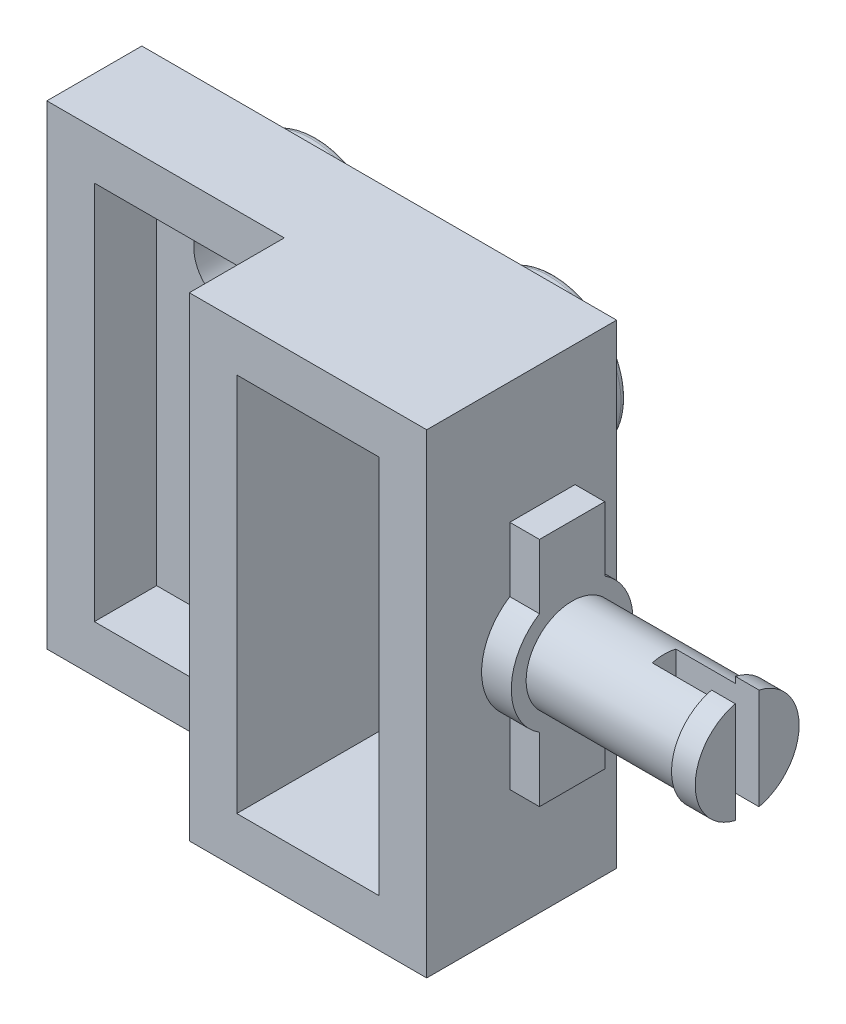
from build123d import *

# Parameters (mm, degrees)
SKIZZE1_W                         = 16
SKIZZE1_H                         = 16
LINEAR_AUSTRAGEN1_DEPTH           = 3.2
SKIZZE2_W                         = 12.8
SKIZZE2_H                         = 12.8
SCHNITT_LINEAR_AUSTRAGEN1_DEPTH   = 2.1
SKIZZE4_R                         = 2.45
LINEAR_AUSTRAGEN3_DEPTH           = 1.9
VERRUNDUNG1_R                     = 0.2
SKIZZE9_R                         = 1.25
LINEAR_AUSTRAGEN5_DEPTH           = 1.8
SKIZZE9_2_R                       = 1.25
SCHNITT_LINEAR_AUSTRAGEN3_DEPTH   = 1.8
LINEARES_MUSTER3_COUNT            = 2
LINEARES_MUSTER3_PITCH            = 8
LINEARES_MUSTER3_COUNT_DIR2       = 2
LINEARES_MUSTER3_PITCH_DIR2       = 8
VERRUNDUNG1_OF_LINEARES_MUSTER3_R = 0.2
SKIZZE10_W                        = 8
SKIZZE10_H                        = 16
SKIZZE10_W_2                      = 4.8
SKIZZE10_H_2                      = 12.8
LINEAR_AUSTRAGEN6_DEPTH           = 5.3
LINEAR_AUSTRAGEN7_DEPTH           = 1
SKIZZE12_R                        = 1.55
LINEAR_AUSTRAGEN8_DEPTH           = 5.1
SKIZZE13_R                        = 1.75
LINEAR_AUSTRAGEN9_DEPTH           = 0.8
SCHNITT_LINEAR_START              = -2.8
SCHNITT_LINEAR_AUSTRAGEN4_DEPTH   = 2.8


with BuildPart() as part:
    # Skizze1 → Linear austragen1 (new body)
    with BuildSketch(Plane.XY):
        with Locations((-8, -8)):
            Rectangle(SKIZZE1_W, SKIZZE1_H)
    extrude(amount=LINEAR_AUSTRAGEN1_DEPTH)

    # Skizze2 → Schnitt-Linear austragen1 (cut)
    with BuildSketch(Plane.XY.offset(3.2)):
        with Locations((-8, -8)):
            Rectangle(SKIZZE2_W, SKIZZE2_H)
    extrude(amount=-SCHNITT_LINEAR_AUSTRAGEN1_DEPTH, mode=Mode.SUBTRACT)

    # Skizze4 → Linear austragen3 (add)
    with BuildSketch(Plane(origin=(0, 0, 0), x_dir=(-1, 0, 0), z_dir=(0, 0, -1))):
        with Locations(Location((4, -4, 0), (0, 0, 180))):
            Circle(SKIZZE4_R)
    linear_austragen3 = extrude(amount=LINEAR_AUSTRAGEN3_DEPTH)

    # Verrundung1
    verrundung1_edges = [part.edges().sort_by_distance(p)[0] for p in [
        (-6.45, -4, -1.9),
    ]]
    fillet(verrundung1_edges, radius=VERRUNDUNG1_R)

    # Skizze9 → Linear austragen5 (add)
    with BuildSketch(Plane.XY.offset(1.1)):
        with Locations((-3.9, -3.9)):
            Circle(SKIZZE9_R)
    extrude(amount=-LINEAR_AUSTRAGEN5_DEPTH)

    # Skizze9_2 → Schnitt-Linear austragen3 (cut)
    with BuildSketch(Plane.XY.offset(1.1)):
        with Locations((-3.9, -3.9)):
            Circle(SKIZZE9_2_R)
    schnitt_linear_austragen3 = extrude(amount=-SCHNITT_LINEAR_AUSTRAGEN3_DEPTH, mode=Mode.SUBTRACT)

    # Lineares Muster3: Linear austragen3, Schnitt-Linear austragen3 2 × 2
    with Locations(*[(-j * LINEARES_MUSTER3_PITCH_DIR2, -i * LINEARES_MUSTER3_PITCH, 0) for i in range(LINEARES_MUSTER3_COUNT) for j in range(LINEARES_MUSTER3_COUNT_DIR2) if (i, j) != (0, 0)]):
        add(linear_austragen3)
        add(schnitt_linear_austragen3, mode=Mode.SUBTRACT)

    # Verrundung1 of Lineares Muster3
    verrundung1_of_lineares_muster3_edges = [part.edges().sort_by_distance(p)[0] for p in [
        (-14.45, -4, -1.9),
        (-6.45, -12, -1.9),
        (-14.45, -12, -1.9),
    ]]
    fillet(verrundung1_of_lineares_muster3_edges, radius=VERRUNDUNG1_OF_LINEARES_MUSTER3_R)

    # Skizze10 → Linear austragen6 (add)
    with BuildSketch(Plane.XY.offset(1.1)):
        with Locations((-4, -8)):
            Rectangle(SKIZZE10_W, SKIZZE10_H)
        with Locations((-4, -8)):
            Rectangle(SKIZZE10_W_2, SKIZZE10_H_2, mode=Mode.SUBTRACT)
    extrude(amount=LINEAR_AUSTRAGEN6_DEPTH)

    # Skizze11 → Linear austragen7 (add)
    with BuildSketch(Plane(origin=(0, 0, 0), x_dir=(0, 0, -1), z_dir=(1, 0, 0))):
        with BuildLine():
            Line((-3.6, -9.729884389), (-3.6, -11.9))
            Line((-3.6, -11.9), (-1.4, -11.9))
            Line((-1.4, -11.9), (-1.4, -9.729884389))
            ThreePointArc((-1.4, -9.729884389), (-0.45, -8), (-1.4, -6.270115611))
            Line((-1.4, -6.270115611), (-1.4, -4.1))
            Line((-1.4, -4.1), (-3.6, -4.1))
            Line((-3.6, -4.1), (-3.6, -6.270115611))
            ThreePointArc((-3.6, -6.270115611), (-4.55, -8), (-3.6, -9.729884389))
        make_face()
    extrude(amount=LINEAR_AUSTRAGEN7_DEPTH)

    # Skizze12 → Linear austragen8 (add)
    with BuildSketch(Plane(origin=(1, 0, 0), x_dir=(0, 0, -1), z_dir=(1, 0, 0))):
        with Locations(Location((-2.5, -8, 0), (0, 0, 90))):
            Circle(SKIZZE12_R)
    extrude(amount=LINEAR_AUSTRAGEN8_DEPTH)

    # Skizze13 → Linear austragen9 (add)
    with BuildSketch(Plane(origin=(6.1, 0, 0), x_dir=(0, 0, -1), z_dir=(1, 0, 0))):
        with Locations(Location((-2.5, -8, 0), (0, 0, 90))):
            Circle(SKIZZE13_R)
    extrude(amount=LINEAR_AUSTRAGEN9_DEPTH)

    # Skizze14 → Schnitt-Linear austragen4 (cut)
    with BuildSketch(Plane(origin=(6.9, 0, 0), x_dir=(0, 0, -1), z_dir=(1, 0, 0)).offset(SCHNITT_LINEAR_START)):
        with BuildLine():
            Line((-2.9, -6.296327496), (-2.9, -9.703672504))
            ThreePointArc((-2.9, -9.703672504), (-2.5, -9.75), (-2.1, -9.703672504))
            Line((-2.1, -9.703672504), (-2.1, -6.296327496))
            ThreePointArc((-2.1, -6.296327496), (-2.5, -6.25), (-2.9, -6.296327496))
        make_face()
    extrude(amount=SCHNITT_LINEAR_AUSTRAGEN4_DEPTH, mode=Mode.SUBTRACT)


solid = part.part
